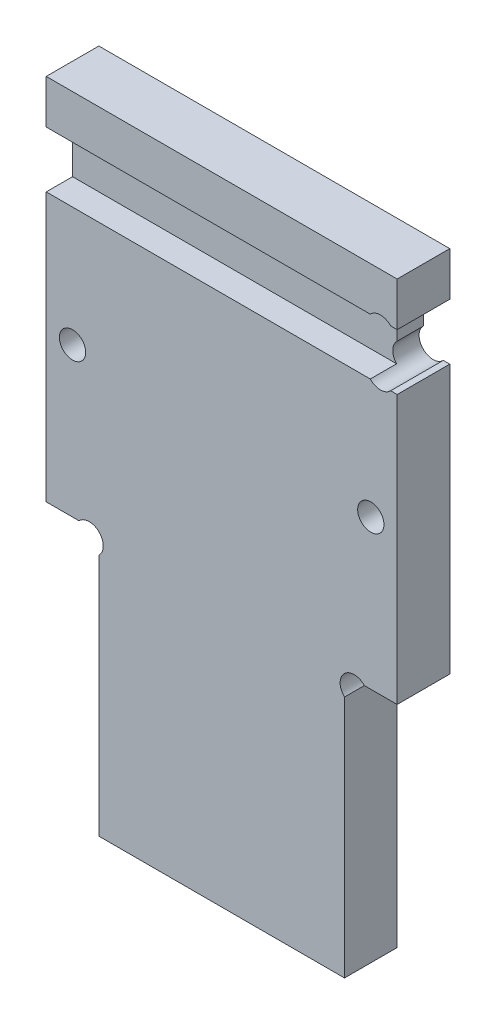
ISO-10303-21;
HEADER;
FILE_DESCRIPTION(('STEP AP214'),'2;1');
FILE_NAME('part.step','',(''),(''),'','','');
FILE_SCHEMA(('AUTOMOTIVE_DESIGN { 1 0 10303 214 1 1 1 1 }'));
ENDSEC;
DATA;
#1=APPLICATION_CONTEXT('core data for automotive mechanical design processes');
#2=APPLICATION_PROTOCOL_DEFINITION('international standard','automotive_design',2000,#1);
#3=PRODUCT_CONTEXT('',#1,'mechanical');
#4=PRODUCT('Part','Part','',(#3));
#5=PRODUCT_RELATED_PRODUCT_CATEGORY('part','',(#4));
#6=PRODUCT_DEFINITION_FORMATION('','',#4);
#7=PRODUCT_DEFINITION_CONTEXT('part definition',#1,'design');
#8=PRODUCT_DEFINITION('design','',#6,#7);
#9=PRODUCT_DEFINITION_SHAPE('','',#8);
#10=(LENGTH_UNIT() NAMED_UNIT(*) SI_UNIT(.MILLI.,.METRE.));
#11=(NAMED_UNIT(*) PLANE_ANGLE_UNIT() SI_UNIT($,.RADIAN.));
#12=(NAMED_UNIT(*) SI_UNIT($,.STERADIAN.) SOLID_ANGLE_UNIT());
#13=UNCERTAINTY_MEASURE_WITH_UNIT(LENGTH_MEASURE(1.E-05),#10,'distance_accuracy_value','');
#14=(GEOMETRIC_REPRESENTATION_CONTEXT(3) GLOBAL_UNCERTAINTY_ASSIGNED_CONTEXT((#13)) GLOBAL_UNIT_ASSIGNED_CONTEXT((#10,
#11,#12)) REPRESENTATION_CONTEXT('',''));
#15=CARTESIAN_POINT('',(0.,0.,0.));
#16=DIRECTION('',(0.,0.,1.));
#17=DIRECTION('',(1.,0.,0.));
#18=AXIS2_PLACEMENT_3D('',#15,#16,#17);
#19=CARTESIAN_POINT('',(-33.3422960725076,36.5735146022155,3.));
#20=DIRECTION('',(0.,-1.,0.));
#21=DIRECTION('',(0.,0.,-1.));
#22=AXIS2_PLACEMENT_3D('',#19,#20,#21);
#23=PLANE('',#22);
#24=DIRECTION('',(1.,0.,0.));
#25=VECTOR('',#24,1.);
#26=CARTESIAN_POINT('',(6.65770392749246,36.5735146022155,0.));
#27=LINE('',#26,#25);
#28=CARTESIAN_POINT('',(5.91959893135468,36.5735146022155,0.));
#29=VERTEX_POINT('',#28);
#30=CARTESIAN_POINT('',(6.65770392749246,36.5735146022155,0.));
#31=VERTEX_POINT('',#30);
#32=EDGE_CURVE('E180',#29,#31,#27,.T.);
#33=ORIENTED_EDGE('',*,*,#32,.F.);
#34=DIRECTION('',(0.,0.,1.));
#35=VECTOR('',#34,1.);
#36=CARTESIAN_POINT('',(5.91959893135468,36.5735146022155,0.));
#37=LINE('',#36,#35);
#38=CARTESIAN_POINT('',(5.91959893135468,36.5735146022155,6.));
#39=VERTEX_POINT('',#38);
#40=EDGE_CURVE('E166',#29,#39,#37,.T.);
#41=ORIENTED_EDGE('',*,*,#40,.T.);
#42=DIRECTION('',(1.,0.,0.));
#43=VECTOR('',#42,1.);
#44=CARTESIAN_POINT('',(-33.3422960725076,36.5735146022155,6.));
#45=LINE('',#44,#43);
#46=CARTESIAN_POINT('',(6.65770392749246,36.5735146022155,6.));
#47=VERTEX_POINT('',#46);
#48=EDGE_CURVE('E237',#39,#47,#45,.T.);
#49=ORIENTED_EDGE('',*,*,#48,.T.);
#50=DIRECTION('',(0.,0.,1.));
#51=VECTOR('',#50,1.);
#52=CARTESIAN_POINT('',(6.65770392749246,36.5735146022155,3.));
#53=LINE('',#52,#51);
#54=EDGE_CURVE('E188',#31,#47,#53,.T.);
#55=ORIENTED_EDGE('',*,*,#54,.F.);
#56=EDGE_LOOP('',(#33,#41,#49,#55));
#57=FACE_BOUND('',#56,.T.);
#58=ADVANCED_FACE('F32',(#57),#23,.F.);
#59=CARTESIAN_POINT('',(-33.3422960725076,42.9735146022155,3.));
#60=DIRECTION('',(0.,1.,0.));
#61=DIRECTION('',(0.,0.,1.));
#62=AXIS2_PLACEMENT_3D('',#59,#60,#61);
#63=PLANE('',#62);
#64=DIRECTION('',(-1.,0.,0.));
#65=VECTOR('',#64,1.);
#66=CARTESIAN_POINT('',(-33.3422960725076,42.9735146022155,3.));
#67=LINE('',#66,#65);
#68=CARTESIAN_POINT('',(3.59580892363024,42.9735146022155,3.));
#69=VERTEX_POINT('',#68);
#70=CARTESIAN_POINT('',(-33.3422960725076,42.9735146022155,3.));
#71=VERTEX_POINT('',#70);
#72=EDGE_CURVE('E251',#69,#71,#67,.T.);
#73=ORIENTED_EDGE('',*,*,#72,.F.);
#74=DIRECTION('',(0.,0.,1.));
#75=VECTOR('',#74,1.);
#76=CARTESIAN_POINT('',(3.59580892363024,42.9735146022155,0.));
#77=LINE('',#76,#75);
#78=CARTESIAN_POINT('',(3.59580892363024,42.9735146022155,6.));
#79=VERTEX_POINT('',#78);
#80=EDGE_CURVE('E327',#69,#79,#77,.T.);
#81=ORIENTED_EDGE('',*,*,#80,.T.);
#82=DIRECTION('',(-1.,0.,0.));
#83=VECTOR('',#82,1.);
#84=CARTESIAN_POINT('',(-33.3422960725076,42.9735146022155,6.));
#85=LINE('',#84,#83);
#86=CARTESIAN_POINT('',(-33.3422960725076,42.9735146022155,6.));
#87=VERTEX_POINT('',#86);
#88=EDGE_CURVE('E241',#79,#87,#85,.T.);
#89=ORIENTED_EDGE('',*,*,#88,.T.);
#90=DIRECTION('',(0.,0.,1.));
#91=VECTOR('',#90,1.);
#92=CARTESIAN_POINT('',(-33.3422960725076,42.9735146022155,3.));
#93=LINE('',#92,#91);
#94=EDGE_CURVE('E254',#71,#87,#93,.T.);
#95=ORIENTED_EDGE('',*,*,#94,.F.);
#96=EDGE_LOOP('',(#73,#81,#89,#95));
#97=FACE_BOUND('',#96,.T.);
#98=ADVANCED_FACE('F402',(#97),#63,.F.);
#99=CARTESIAN_POINT('',(6.65770392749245,47.9735146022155,6.));
#100=DIRECTION('',(-1.,0.,0.));
#101=DIRECTION('',(0.,-1.,0.));
#102=AXIS2_PLACEMENT_3D('',#99,#100,#101);
#103=PLANE('',#102);
#104=DIRECTION('',(0.,1.,0.));
#105=VECTOR('',#104,1.);
#106=CARTESIAN_POINT('',(6.65770392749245,47.9735146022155,0.));
#107=LINE('',#106,#105);
#108=CARTESIAN_POINT('',(6.65770392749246,5.97351460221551,0.));
#109=VERTEX_POINT('',#108);
#110=EDGE_CURVE('E268',#109,#31,#107,.T.);
#111=ORIENTED_EDGE('',*,*,#110,.T.);
#112=ORIENTED_EDGE('',*,*,#54,.T.);
#113=DIRECTION('',(0.,1.,0.));
#114=VECTOR('',#113,1.);
#115=CARTESIAN_POINT('',(6.65770392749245,47.9735146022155,6.));
#116=LINE('',#115,#114);
#117=CARTESIAN_POINT('',(6.65770392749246,5.97351460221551,6.));
#118=VERTEX_POINT('',#117);
#119=EDGE_CURVE('E280',#118,#47,#116,.T.);
#120=ORIENTED_EDGE('',*,*,#119,.F.);
#121=DIRECTION('',(0.,0.,1.));
#122=VECTOR('',#121,1.);
#123=CARTESIAN_POINT('',(6.65770392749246,5.97351460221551,0.));
#124=LINE('',#123,#122);
#125=EDGE_CURVE('E205',#109,#118,#124,.T.);
#126=ORIENTED_EDGE('',*,*,#125,.F.);
#127=EDGE_LOOP('',(#111,#112,#120,#126));
#128=FACE_BOUND('',#127,.T.);
#129=ADVANCED_FACE('F355',(#128),#103,.F.);
#130=CARTESIAN_POINT('',(-33.3422960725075,-24.0264853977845,6.));
#131=DIRECTION('',(0.,0.,1.));
#132=DIRECTION('',(1.,0.,0.));
#133=AXIS2_PLACEMENT_3D('',#130,#131,#132);
#134=PLANE('',#133);
#135=CARTESIAN_POINT('',(4.75770392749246,41.8735146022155,6.));
#136=DIRECTION('',(0.,0.,1.));
#137=DIRECTION('',(1.,0.,0.));
#138=AXIS2_PLACEMENT_3D('',#135,#136,#137);
#139=CIRCLE('',#138,1.59999999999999);
#140=CARTESIAN_POINT('',(5.91959893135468,42.9735146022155,6.));
#141=VERTEX_POINT('',#140);
#142=EDGE_CURVE('E173',#141,#79,#139,.T.);
#143=ORIENTED_EDGE('',*,*,#142,.F.);
#144=CARTESIAN_POINT('',(6.65770392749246,42.9735146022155,6.));
#145=VERTEX_POINT('',#144);
#146=EDGE_CURVE('E242',#145,#141,#85,.T.);
#147=ORIENTED_EDGE('',*,*,#146,.F.);
#148=CARTESIAN_POINT('',(6.65770392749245,47.9735146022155,6.));
#149=VERTEX_POINT('',#148);
#150=EDGE_CURVE('E279',#145,#149,#116,.T.);
#151=ORIENTED_EDGE('',*,*,#150,.T.);
#152=DIRECTION('',(-1.,0.,0.));
#153=VECTOR('',#152,1.);
#154=CARTESIAN_POINT('',(-33.3422960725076,47.9735146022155,6.));
#155=LINE('',#154,#153);
#156=CARTESIAN_POINT('',(-33.3422960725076,47.9735146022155,6.));
#157=VERTEX_POINT('',#156);
#158=EDGE_CURVE('E283',#149,#157,#155,.T.);
#159=ORIENTED_EDGE('',*,*,#158,.T.);
#160=DIRECTION('',(0.,-1.,0.));
#161=VECTOR('',#160,1.);
#162=CARTESIAN_POINT('',(-33.3422960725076,47.9735146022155,6.));
#163=LINE('',#162,#161);
#164=EDGE_CURVE('E273',#157,#87,#163,.T.);
#165=ORIENTED_EDGE('',*,*,#164,.T.);
#166=ORIENTED_EDGE('',*,*,#88,.F.);
#167=EDGE_LOOP('',(#143,#147,#151,#159,#165,#166));
#168=FACE_BOUND('',#167,.T.);
#169=ADVANCED_FACE('F400',(#168),#134,.T.);
#170=CARTESIAN_POINT('',(-33.3422960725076,47.9735146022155,6.));
#171=DIRECTION('',(1.,0.,0.));
#172=DIRECTION('',(0.,1.,0.));
#173=AXIS2_PLACEMENT_3D('',#170,#171,#172);
#174=PLANE('',#173);
#175=DIRECTION('',(0.,-1.,0.));
#176=VECTOR('',#175,1.);
#177=CARTESIAN_POINT('',(-33.3422960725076,47.9735146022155,0.));
#178=LINE('',#177,#176);
#179=CARTESIAN_POINT('',(-33.3422960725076,47.9735146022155,0.));
#180=VERTEX_POINT('',#179);
#181=CARTESIAN_POINT('',(-33.3422960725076,5.97351460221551,0.));
#182=VERTEX_POINT('',#181);
#183=EDGE_CURVE('E257',#180,#182,#178,.T.);
#184=ORIENTED_EDGE('',*,*,#183,.T.);
#185=DIRECTION('',(0.,0.,1.));
#186=VECTOR('',#185,1.);
#187=CARTESIAN_POINT('',(-33.3422960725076,5.97351460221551,0.));
#188=LINE('',#187,#186);
#189=CARTESIAN_POINT('',(-33.3422960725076,5.97351460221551,6.));
#190=VERTEX_POINT('',#189);
#191=EDGE_CURVE('E221',#182,#190,#188,.T.);
#192=ORIENTED_EDGE('',*,*,#191,.T.);
#193=CARTESIAN_POINT('',(-33.3422960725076,36.5735146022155,6.));
#194=VERTEX_POINT('',#193);
#195=EDGE_CURVE('E272',#194,#190,#163,.T.);
#196=ORIENTED_EDGE('',*,*,#195,.F.);
#197=DIRECTION('',(0.,0.,1.));
#198=VECTOR('',#197,1.);
#199=CARTESIAN_POINT('',(-33.3422960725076,36.5735146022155,3.));
#200=LINE('',#199,#198);
#201=CARTESIAN_POINT('',(-33.3422960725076,36.5735146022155,3.));
#202=VERTEX_POINT('',#201);
#203=EDGE_CURVE('E253',#202,#194,#200,.T.);
#204=ORIENTED_EDGE('',*,*,#203,.F.);
#205=DIRECTION('',(0.,-1.,0.));
#206=VECTOR('',#205,1.);
#207=CARTESIAN_POINT('',(-33.3422960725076,42.9735146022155,3.));
#208=LINE('',#207,#206);
#209=EDGE_CURVE('E245',#71,#202,#208,.T.);
#210=ORIENTED_EDGE('',*,*,#209,.F.);
#211=ORIENTED_EDGE('',*,*,#94,.T.);
#212=ORIENTED_EDGE('',*,*,#164,.F.);
#213=DIRECTION('',(0.,0.,-1.));
#214=VECTOR('',#213,1.);
#215=CARTESIAN_POINT('',(-33.3422960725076,47.9735146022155,6.));
#216=LINE('',#215,#214);
#217=EDGE_CURVE('E285',#157,#180,#216,.T.);
#218=ORIENTED_EDGE('',*,*,#217,.T.);
#219=EDGE_LOOP('',(#184,#192,#196,#204,#210,#211,#212,#218));
#220=FACE_BOUND('',#219,.T.);
#221=ADVANCED_FACE('F34',(#220),#174,.F.);
#222=CARTESIAN_POINT('',(-33.3422960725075,-24.0264853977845,6.));
#223=DIRECTION('',(0.,1.,0.));
#224=DIRECTION('',(0.,0.,1.));
#225=AXIS2_PLACEMENT_3D('',#222,#223,#224);
#226=PLANE('',#225);
#227=DIRECTION('',(1.,0.,0.));
#228=VECTOR('',#227,1.);
#229=CARTESIAN_POINT('',(-33.3422960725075,-24.0264853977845,0.));
#230=LINE('',#229,#228);
#231=CARTESIAN_POINT('',(-27.3422960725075,-24.0264853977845,0.));
#232=VERTEX_POINT('',#231);
#233=CARTESIAN_POINT('',(0.657703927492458,-24.0264853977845,0.));
#234=VERTEX_POINT('',#233);
#235=EDGE_CURVE('E264',#232,#234,#230,.T.);
#236=ORIENTED_EDGE('',*,*,#235,.T.);
#237=DIRECTION('',(0.,0.,1.));
#238=VECTOR('',#237,1.);
#239=CARTESIAN_POINT('',(0.657703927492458,-24.0264853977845,0.));
#240=LINE('',#239,#238);
#241=CARTESIAN_POINT('',(0.657703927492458,-24.0264853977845,6.));
#242=VERTEX_POINT('',#241);
#243=EDGE_CURVE('E206',#234,#242,#240,.T.);
#244=ORIENTED_EDGE('',*,*,#243,.T.);
#245=DIRECTION('',(1.,0.,0.));
#246=VECTOR('',#245,1.);
#247=CARTESIAN_POINT('',(-33.3422960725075,-24.0264853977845,6.));
#248=LINE('',#247,#246);
#249=CARTESIAN_POINT('',(-27.3422960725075,-24.0264853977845,6.));
#250=VERTEX_POINT('',#249);
#251=EDGE_CURVE('E276',#250,#242,#248,.T.);
#252=ORIENTED_EDGE('',*,*,#251,.F.);
#253=DIRECTION('',(0.,0.,1.));
#254=VECTOR('',#253,1.);
#255=CARTESIAN_POINT('',(-27.3422960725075,-24.0264853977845,0.));
#256=LINE('',#255,#254);
#257=EDGE_CURVE('E220',#232,#250,#256,.T.);
#258=ORIENTED_EDGE('',*,*,#257,.F.);
#259=EDGE_LOOP('',(#236,#244,#252,#258));
#260=FACE_BOUND('',#259,.T.);
#261=ADVANCED_FACE('F368',(#260),#226,.F.);
#262=DIRECTION('',(0.,0.,1.));
#263=VECTOR('',#262,1.);
#264=CARTESIAN_POINT('',(6.65770392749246,42.9735146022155,3.));
#265=LINE('',#264,#263);
#266=CARTESIAN_POINT('',(6.65770392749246,42.9735146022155,0.));
#267=VERTEX_POINT('',#266);
#268=EDGE_CURVE('E258',#267,#145,#265,.T.);
#269=ORIENTED_EDGE('',*,*,#268,.F.);
#270=CARTESIAN_POINT('',(6.65770392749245,47.9735146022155,0.));
#271=VERTEX_POINT('',#270);
#272=EDGE_CURVE('E267',#267,#271,#107,.T.);
#273=ORIENTED_EDGE('',*,*,#272,.T.);
#274=DIRECTION('',(0.,0.,-1.));
#275=VECTOR('',#274,1.);
#276=CARTESIAN_POINT('',(6.65770392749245,47.9735146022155,6.));
#277=LINE('',#276,#275);
#278=EDGE_CURVE('E288',#149,#271,#277,.T.);
#279=ORIENTED_EDGE('',*,*,#278,.F.);
#280=ORIENTED_EDGE('',*,*,#150,.F.);
#281=EDGE_LOOP('',(#269,#273,#279,#280));
#282=FACE_BOUND('',#281,.T.);
#283=ADVANCED_FACE('F391',(#282),#103,.F.);
#284=CARTESIAN_POINT('',(-33.3422960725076,47.9735146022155,6.));
#285=DIRECTION('',(0.,-1.,0.));
#286=DIRECTION('',(0.,0.,-1.));
#287=AXIS2_PLACEMENT_3D('',#284,#285,#286);
#288=PLANE('',#287);
#289=DIRECTION('',(-1.,0.,0.));
#290=VECTOR('',#289,1.);
#291=CARTESIAN_POINT('',(-33.3422960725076,47.9735146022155,0.));
#292=LINE('',#291,#290);
#293=EDGE_CURVE('E270',#271,#180,#292,.T.);
#294=ORIENTED_EDGE('',*,*,#293,.T.);
#295=ORIENTED_EDGE('',*,*,#217,.F.);
#296=ORIENTED_EDGE('',*,*,#158,.F.);
#297=ORIENTED_EDGE('',*,*,#278,.T.);
#298=EDGE_LOOP('',(#294,#295,#296,#297));
#299=FACE_BOUND('',#298,.T.);
#300=ADVANCED_FACE('F386',(#299),#288,.F.);
#301=CARTESIAN_POINT('',(4.75770392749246,37.6735146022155,6.));
#302=DIRECTION('',(0.,0.,1.));
#303=DIRECTION('',(1.,0.,0.));
#304=AXIS2_PLACEMENT_3D('',#301,#302,#303);
#305=CIRCLE('',#304,1.59999999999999);
#306=CARTESIAN_POINT('',(3.59580892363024,36.5735146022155,6.));
#307=VERTEX_POINT('',#306);
#308=EDGE_CURVE('E169',#307,#39,#305,.T.);
#309=ORIENTED_EDGE('',*,*,#308,.F.);
#310=EDGE_CURVE('E238',#194,#307,#45,.T.);
#311=ORIENTED_EDGE('',*,*,#310,.F.);
#312=ORIENTED_EDGE('',*,*,#195,.T.);
#313=DIRECTION('',(-1.,0.,0.));
#314=VECTOR('',#313,1.);
#315=CARTESIAN_POINT('',(-33.3422960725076,5.97351460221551,6.));
#316=LINE('',#315,#314);
#317=CARTESIAN_POINT('',(-29.6041910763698,5.97351460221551,6.));
#318=VERTEX_POINT('',#317);
#319=EDGE_CURVE('E213',#318,#190,#316,.T.);
#320=ORIENTED_EDGE('',*,*,#319,.F.);
#321=CARTESIAN_POINT('',(-28.4422960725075,4.87351460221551,6.));
#322=DIRECTION('',(0.,0.,1.));
#323=DIRECTION('',(1.,0.,0.));
#324=AXIS2_PLACEMENT_3D('',#321,#322,#323);
#325=CIRCLE('',#324,1.6);
#326=CARTESIAN_POINT('',(-27.3422960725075,3.71161959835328,6.));
#327=VERTEX_POINT('',#326);
#328=EDGE_CURVE('E314',#327,#318,#325,.T.);
#329=ORIENTED_EDGE('',*,*,#328,.F.);
#330=DIRECTION('',(0.,1.,0.));
#331=VECTOR('',#330,1.);
#332=CARTESIAN_POINT('',(-27.3422960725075,-24.0264853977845,6.));
#333=LINE('',#332,#331);
#334=EDGE_CURVE('E209',#250,#327,#333,.T.);
#335=ORIENTED_EDGE('',*,*,#334,.F.);
#336=ORIENTED_EDGE('',*,*,#251,.T.);
#337=DIRECTION('',(0.,-1.,0.));
#338=VECTOR('',#337,1.);
#339=CARTESIAN_POINT('',(0.657703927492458,-24.0264853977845,6.));
#340=LINE('',#339,#338);
#341=CARTESIAN_POINT('',(0.657703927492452,3.71161959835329,6.));
#342=VERTEX_POINT('',#341);
#343=EDGE_CURVE('E193',#342,#242,#340,.T.);
#344=ORIENTED_EDGE('',*,*,#343,.F.);
#345=CARTESIAN_POINT('',(1.75770392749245,4.87351460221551,6.));
#346=DIRECTION('',(0.,0.,1.));
#347=DIRECTION('',(1.,0.,0.));
#348=AXIS2_PLACEMENT_3D('',#345,#346,#347);
#349=CIRCLE('',#348,1.6);
#350=CARTESIAN_POINT('',(2.91959893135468,5.97351460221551,6.));
#351=VERTEX_POINT('',#350);
#352=EDGE_CURVE('E322',#351,#342,#349,.T.);
#353=ORIENTED_EDGE('',*,*,#352,.F.);
#354=DIRECTION('',(-1.,0.,0.));
#355=VECTOR('',#354,1.);
#356=CARTESIAN_POINT('',(6.65770392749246,5.97351460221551,6.));
#357=LINE('',#356,#355);
#358=EDGE_CURVE('E190',#118,#351,#357,.T.);
#359=ORIENTED_EDGE('',*,*,#358,.F.);
#360=ORIENTED_EDGE('',*,*,#119,.T.);
#361=ORIENTED_EDGE('',*,*,#48,.F.);
#362=EDGE_LOOP('',(#309,#311,#312,#320,#329,#335,#336,#344,#353,#359,#360,#361));
#363=FACE_BOUND('',#362,.T.);
#364=CARTESIAN_POINT('',(-30.3422960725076,22.9735146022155,6.));
#365=DIRECTION('',(0.,0.,1.));
#366=DIRECTION('',(1.,0.,0.));
#367=AXIS2_PLACEMENT_3D('',#364,#365,#366);
#368=CIRCLE('',#367,1.5);
#369=CARTESIAN_POINT('',(-28.8422960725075,22.9735146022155,6.));
#370=VERTEX_POINT('',#369);
#371=EDGE_CURVE('E224',#370,#370,#368,.T.);
#372=ORIENTED_EDGE('',*,*,#371,.F.);
#373=EDGE_LOOP('',(#372));
#374=FACE_BOUND('',#373,.T.);
#375=CARTESIAN_POINT('',(3.65770392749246,22.9735146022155,6.));
#376=DIRECTION('',(0.,0.,1.));
#377=DIRECTION('',(1.,0.,0.));
#378=AXIS2_PLACEMENT_3D('',#375,#376,#377);
#379=CIRCLE('',#378,1.5);
#380=CARTESIAN_POINT('',(5.15770392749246,22.9735146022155,6.));
#381=VERTEX_POINT('',#380);
#382=EDGE_CURVE('E231',#381,#381,#379,.T.);
#383=ORIENTED_EDGE('',*,*,#382,.F.);
#384=EDGE_LOOP('',(#383));
#385=FACE_BOUND('',#384,.T.);
#386=ADVANCED_FACE('F347',(#363,#374,#385),#134,.T.);
#387=CARTESIAN_POINT('',(-33.3422960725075,-24.0264853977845,0.));
#388=DIRECTION('',(0.,0.,1.));
#389=DIRECTION('',(1.,0.,0.));
#390=AXIS2_PLACEMENT_3D('',#387,#388,#389);
#391=PLANE('',#390);
#392=CARTESIAN_POINT('',(-30.3422960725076,22.9735146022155,0.));
#393=DIRECTION('',(0.,0.,1.));
#394=DIRECTION('',(1.,0.,0.));
#395=AXIS2_PLACEMENT_3D('',#392,#393,#394);
#396=CIRCLE('',#395,1.5);
#397=CARTESIAN_POINT('',(-28.8422960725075,22.9735146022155,0.));
#398=VERTEX_POINT('',#397);
#399=EDGE_CURVE('E228',#398,#398,#396,.T.);
#400=ORIENTED_EDGE('',*,*,#399,.T.);
#401=EDGE_LOOP('',(#400));
#402=FACE_BOUND('',#401,.T.);
#403=CARTESIAN_POINT('',(3.65770392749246,22.9735146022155,0.));
#404=DIRECTION('',(0.,0.,1.));
#405=DIRECTION('',(1.,0.,0.));
#406=AXIS2_PLACEMENT_3D('',#403,#404,#405);
#407=CIRCLE('',#406,1.5);
#408=CARTESIAN_POINT('',(5.15770392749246,22.9735146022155,0.));
#409=VERTEX_POINT('',#408);
#410=EDGE_CURVE('E234',#409,#409,#407,.T.);
#411=ORIENTED_EDGE('',*,*,#410,.T.);
#412=EDGE_LOOP('',(#411));
#413=FACE_BOUND('',#412,.T.);
#414=DIRECTION('',(0.,-1.,0.));
#415=VECTOR('',#414,1.);
#416=CARTESIAN_POINT('',(3.65770392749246,42.9735146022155,0.));
#417=LINE('',#416,#415);
#418=CARTESIAN_POINT('',(3.65770392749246,40.7116195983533,0.));
#419=VERTEX_POINT('',#418);
#420=CARTESIAN_POINT('',(3.65770392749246,38.8354096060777,0.));
#421=VERTEX_POINT('',#420);
#422=EDGE_CURVE('E184',#419,#421,#417,.T.);
#423=ORIENTED_EDGE('',*,*,#422,.T.);
#424=CARTESIAN_POINT('',(4.75770392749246,37.6735146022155,0.));
#425=DIRECTION('',(0.,0.,1.));
#426=DIRECTION('',(1.,0.,0.));
#427=AXIS2_PLACEMENT_3D('',#424,#425,#426);
#428=CIRCLE('',#427,1.59999999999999);
#429=EDGE_CURVE('E47',#421,#29,#428,.T.);
#430=ORIENTED_EDGE('',*,*,#429,.T.);
#431=ORIENTED_EDGE('',*,*,#32,.T.);
#432=ORIENTED_EDGE('',*,*,#110,.F.);
#433=DIRECTION('',(-1.,0.,0.));
#434=VECTOR('',#433,1.);
#435=CARTESIAN_POINT('',(6.65770392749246,5.97351460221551,0.));
#436=LINE('',#435,#434);
#437=CARTESIAN_POINT('',(2.91959893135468,5.97351460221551,0.));
#438=VERTEX_POINT('',#437);
#439=EDGE_CURVE('E200',#109,#438,#436,.T.);
#440=ORIENTED_EDGE('',*,*,#439,.T.);
#441=CARTESIAN_POINT('',(1.75770392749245,4.87351460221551,0.));
#442=DIRECTION('',(0.,0.,1.));
#443=DIRECTION('',(1.,0.,0.));
#444=AXIS2_PLACEMENT_3D('',#441,#442,#443);
#445=CIRCLE('',#444,1.6);
#446=CARTESIAN_POINT('',(0.657703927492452,3.71161959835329,0.));
#447=VERTEX_POINT('',#446);
#448=EDGE_CURVE('E319',#438,#447,#445,.T.);
#449=ORIENTED_EDGE('',*,*,#448,.T.);
#450=DIRECTION('',(0.,-1.,0.));
#451=VECTOR('',#450,1.);
#452=CARTESIAN_POINT('',(0.657703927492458,-24.0264853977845,0.));
#453=LINE('',#452,#451);
#454=EDGE_CURVE('E203',#447,#234,#453,.T.);
#455=ORIENTED_EDGE('',*,*,#454,.T.);
#456=ORIENTED_EDGE('',*,*,#235,.F.);
#457=DIRECTION('',(0.,1.,0.));
#458=VECTOR('',#457,1.);
#459=CARTESIAN_POINT('',(-27.3422960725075,-24.0264853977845,0.));
#460=LINE('',#459,#458);
#461=CARTESIAN_POINT('',(-27.3422960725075,3.71161959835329,0.));
#462=VERTEX_POINT('',#461);
#463=EDGE_CURVE('E215',#232,#462,#460,.T.);
#464=ORIENTED_EDGE('',*,*,#463,.T.);
#465=CARTESIAN_POINT('',(-28.4422960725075,4.87351460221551,0.));
#466=DIRECTION('',(0.,0.,1.));
#467=DIRECTION('',(1.,0.,0.));
#468=AXIS2_PLACEMENT_3D('',#465,#466,#467);
#469=CIRCLE('',#468,1.6);
#470=CARTESIAN_POINT('',(-29.6041910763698,5.97351460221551,0.));
#471=VERTEX_POINT('',#470);
#472=EDGE_CURVE('E309',#462,#471,#469,.T.);
#473=ORIENTED_EDGE('',*,*,#472,.T.);
#474=DIRECTION('',(-1.,0.,0.));
#475=VECTOR('',#474,1.);
#476=CARTESIAN_POINT('',(-33.3422960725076,5.97351460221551,0.));
#477=LINE('',#476,#475);
#478=EDGE_CURVE('E218',#471,#182,#477,.T.);
#479=ORIENTED_EDGE('',*,*,#478,.T.);
#480=ORIENTED_EDGE('',*,*,#183,.F.);
#481=ORIENTED_EDGE('',*,*,#293,.F.);
#482=ORIENTED_EDGE('',*,*,#272,.F.);
#483=DIRECTION('',(-1.,0.,0.));
#484=VECTOR('',#483,1.);
#485=CARTESIAN_POINT('',(6.65770392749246,42.9735146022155,0.));
#486=LINE('',#485,#484);
#487=CARTESIAN_POINT('',(5.91959893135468,42.9735146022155,0.));
#488=VERTEX_POINT('',#487);
#489=EDGE_CURVE('E195',#267,#488,#486,.T.);
#490=ORIENTED_EDGE('',*,*,#489,.T.);
#491=CARTESIAN_POINT('',(4.75770392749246,41.8735146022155,0.));
#492=DIRECTION('',(0.,0.,1.));
#493=DIRECTION('',(1.,0.,0.));
#494=AXIS2_PLACEMENT_3D('',#491,#492,#493);
#495=CIRCLE('',#494,1.59999999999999);
#496=EDGE_CURVE('E331',#488,#419,#495,.T.);
#497=ORIENTED_EDGE('',*,*,#496,.T.);
#498=EDGE_LOOP('',(#423,#430,#431,#432,#440,#449,#455,#456,#464,#473,#479,#480,#481,#482,#490,#497));
#499=FACE_BOUND('',#498,.T.);
#500=ADVANCED_FACE('F178',(#402,#413,#499),#391,.F.);
#501=ORIENTED_EDGE('',*,*,#146,.T.);
#502=DIRECTION('',(0.,0.,1.));
#503=VECTOR('',#502,1.);
#504=CARTESIAN_POINT('',(5.91959893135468,42.9735146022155,0.));
#505=LINE('',#504,#503);
#506=EDGE_CURVE('E324',#141,#488,#505,.F.);
#507=ORIENTED_EDGE('',*,*,#506,.T.);
#508=ORIENTED_EDGE('',*,*,#489,.F.);
#509=ORIENTED_EDGE('',*,*,#268,.T.);
#510=EDGE_LOOP('',(#501,#507,#508,#509));
#511=FACE_BOUND('',#510,.T.);
#512=ADVANCED_FACE('F395',(#511),#63,.F.);
#513=ORIENTED_EDGE('',*,*,#310,.T.);
#514=DIRECTION('',(0.,0.,1.));
#515=VECTOR('',#514,1.);
#516=CARTESIAN_POINT('',(3.59580892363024,36.5735146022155,0.));
#517=LINE('',#516,#515);
#518=CARTESIAN_POINT('',(3.59580892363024,36.5735146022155,3.));
#519=VERTEX_POINT('',#518);
#520=EDGE_CURVE('E174',#307,#519,#517,.F.);
#521=ORIENTED_EDGE('',*,*,#520,.T.);
#522=DIRECTION('',(1.,0.,0.));
#523=VECTOR('',#522,1.);
#524=CARTESIAN_POINT('',(-33.3422960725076,36.5735146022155,3.));
#525=LINE('',#524,#523);
#526=EDGE_CURVE('E248',#202,#519,#525,.T.);
#527=ORIENTED_EDGE('',*,*,#526,.F.);
#528=ORIENTED_EDGE('',*,*,#203,.T.);
#529=EDGE_LOOP('',(#513,#521,#527,#528));
#530=FACE_BOUND('',#529,.T.);
#531=ADVANCED_FACE('F338',(#530),#23,.F.);
#532=CARTESIAN_POINT('',(-33.3422960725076,36.5735146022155,3.));
#533=DIRECTION('',(0.,0.,1.));
#534=DIRECTION('',(1.,0.,0.));
#535=AXIS2_PLACEMENT_3D('',#532,#533,#534);
#536=PLANE('',#535);
#537=CARTESIAN_POINT('',(4.75770392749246,37.6735146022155,3.));
#538=DIRECTION('',(0.,0.,1.));
#539=DIRECTION('',(1.,0.,0.));
#540=AXIS2_PLACEMENT_3D('',#537,#538,#539);
#541=CIRCLE('',#540,1.59999999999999);
#542=CARTESIAN_POINT('',(3.65770392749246,38.8354096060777,3.));
#543=VERTEX_POINT('',#542);
#544=EDGE_CURVE('E185',#543,#519,#541,.T.);
#545=ORIENTED_EDGE('',*,*,#544,.F.);
#546=DIRECTION('',(0.,-1.,0.));
#547=VECTOR('',#546,1.);
#548=CARTESIAN_POINT('',(3.65770392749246,42.9735146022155,3.));
#549=LINE('',#548,#547);
#550=CARTESIAN_POINT('',(3.65770392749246,40.7116195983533,3.));
#551=VERTEX_POINT('',#550);
#552=EDGE_CURVE('E300',#551,#543,#549,.T.);
#553=ORIENTED_EDGE('',*,*,#552,.F.);
#554=CARTESIAN_POINT('',(4.75770392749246,41.8735146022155,3.));
#555=DIRECTION('',(0.,0.,1.));
#556=DIRECTION('',(1.,0.,0.));
#557=AXIS2_PLACEMENT_3D('',#554,#555,#556);
#558=CIRCLE('',#557,1.59999999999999);
#559=EDGE_CURVE('E54',#69,#551,#558,.T.);
#560=ORIENTED_EDGE('',*,*,#559,.F.);
#561=ORIENTED_EDGE('',*,*,#72,.T.);
#562=ORIENTED_EDGE('',*,*,#209,.T.);
#563=ORIENTED_EDGE('',*,*,#526,.T.);
#564=EDGE_LOOP('',(#545,#553,#560,#561,#562,#563));
#565=FACE_BOUND('',#564,.T.);
#566=ADVANCED_FACE('F303',(#565),#536,.T.);
#567=CARTESIAN_POINT('',(3.65770392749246,22.9735146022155,0.));
#568=DIRECTION('',(0.,0.,1.));
#569=DIRECTION('',(1.,0.,0.));
#570=AXIS2_PLACEMENT_3D('',#567,#568,#569);
#571=CYLINDRICAL_SURFACE('',#570,1.5);
#572=ORIENTED_EDGE('',*,*,#410,.F.);
#573=EDGE_LOOP('',(#572));
#574=FACE_BOUND('',#573,.T.);
#575=ORIENTED_EDGE('',*,*,#382,.T.);
#576=EDGE_LOOP('',(#575));
#577=FACE_BOUND('',#576,.T.);
#578=ADVANCED_FACE('F513',(#574,#577),#571,.F.);
#579=CARTESIAN_POINT('',(-30.3422960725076,22.9735146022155,0.));
#580=DIRECTION('',(0.,0.,1.));
#581=DIRECTION('',(1.,0.,0.));
#582=AXIS2_PLACEMENT_3D('',#579,#580,#581);
#583=CYLINDRICAL_SURFACE('',#582,1.5);
#584=ORIENTED_EDGE('',*,*,#399,.F.);
#585=EDGE_LOOP('',(#584));
#586=FACE_BOUND('',#585,.T.);
#587=ORIENTED_EDGE('',*,*,#371,.T.);
#588=EDGE_LOOP('',(#587));
#589=FACE_BOUND('',#588,.T.);
#590=ADVANCED_FACE('F518',(#586,#589),#583,.F.);
#591=CARTESIAN_POINT('',(-33.3422960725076,5.97351460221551,0.));
#592=DIRECTION('',(0.,1.,0.));
#593=DIRECTION('',(0.,0.,1.));
#594=AXIS2_PLACEMENT_3D('',#591,#592,#593);
#595=PLANE('',#594);
#596=ORIENTED_EDGE('',*,*,#478,.F.);
#597=DIRECTION('',(0.,0.,1.));
#598=VECTOR('',#597,1.);
#599=CARTESIAN_POINT('',(-29.6041910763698,5.97351460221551,0.));
#600=LINE('',#599,#598);
#601=EDGE_CURVE('E305',#471,#318,#600,.T.);
#602=ORIENTED_EDGE('',*,*,#601,.T.);
#603=ORIENTED_EDGE('',*,*,#319,.T.);
#604=ORIENTED_EDGE('',*,*,#191,.F.);
#605=EDGE_LOOP('',(#596,#602,#603,#604));
#606=FACE_BOUND('',#605,.T.);
#607=ADVANCED_FACE('F379',(#606),#595,.F.);
#608=CARTESIAN_POINT('',(-27.3422960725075,-24.0264853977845,0.));
#609=DIRECTION('',(1.,0.,0.));
#610=DIRECTION('',(0.,0.,-1.));
#611=AXIS2_PLACEMENT_3D('',#608,#609,#610);
#612=PLANE('',#611);
#613=ORIENTED_EDGE('',*,*,#334,.T.);
#614=DIRECTION('',(0.,0.,1.));
#615=VECTOR('',#614,1.);
#616=CARTESIAN_POINT('',(-27.3422960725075,3.71161959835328,0.));
#617=LINE('',#616,#615);
#618=EDGE_CURVE('E291',#327,#462,#617,.F.);
#619=ORIENTED_EDGE('',*,*,#618,.T.);
#620=ORIENTED_EDGE('',*,*,#463,.F.);
#621=ORIENTED_EDGE('',*,*,#257,.T.);
#622=EDGE_LOOP('',(#613,#619,#620,#621));
#623=FACE_BOUND('',#622,.T.);
#624=ADVANCED_FACE('F373',(#623),#612,.F.);
#625=CARTESIAN_POINT('',(0.657703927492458,-24.0264853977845,0.));
#626=DIRECTION('',(-1.,0.,0.));
#627=DIRECTION('',(0.,-1.,0.));
#628=AXIS2_PLACEMENT_3D('',#625,#626,#627);
#629=PLANE('',#628);
#630=ORIENTED_EDGE('',*,*,#454,.F.);
#631=DIRECTION('',(0.,0.,1.));
#632=VECTOR('',#631,1.);
#633=CARTESIAN_POINT('',(0.657703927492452,3.71161959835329,0.));
#634=LINE('',#633,#632);
#635=EDGE_CURVE('E316',#447,#342,#634,.T.);
#636=ORIENTED_EDGE('',*,*,#635,.T.);
#637=ORIENTED_EDGE('',*,*,#343,.T.);
#638=ORIENTED_EDGE('',*,*,#243,.F.);
#639=EDGE_LOOP('',(#630,#636,#637,#638));
#640=FACE_BOUND('',#639,.T.);
#641=ADVANCED_FACE('F366',(#640),#629,.F.);
#642=CARTESIAN_POINT('',(6.65770392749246,5.97351460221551,0.));
#643=DIRECTION('',(0.,1.,0.));
#644=DIRECTION('',(-1.,0.,0.));
#645=AXIS2_PLACEMENT_3D('',#642,#643,#644);
#646=PLANE('',#645);
#647=ORIENTED_EDGE('',*,*,#358,.T.);
#648=DIRECTION('',(0.,0.,1.));
#649=VECTOR('',#648,1.);
#650=CARTESIAN_POINT('',(2.91959893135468,5.97351460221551,0.));
#651=LINE('',#650,#649);
#652=EDGE_CURVE('E294',#351,#438,#651,.F.);
#653=ORIENTED_EDGE('',*,*,#652,.T.);
#654=ORIENTED_EDGE('',*,*,#439,.F.);
#655=ORIENTED_EDGE('',*,*,#125,.T.);
#656=EDGE_LOOP('',(#647,#653,#654,#655));
#657=FACE_BOUND('',#656,.T.);
#658=ADVANCED_FACE('F358',(#657),#646,.F.);
#659=CARTESIAN_POINT('',(3.65770392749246,42.9735146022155,0.));
#660=DIRECTION('',(-1.,0.,0.));
#661=DIRECTION('',(0.,-1.,0.));
#662=AXIS2_PLACEMENT_3D('',#659,#660,#661);
#663=PLANE('',#662);
#664=ORIENTED_EDGE('',*,*,#552,.T.);
#665=DIRECTION('',(0.,0.,1.));
#666=VECTOR('',#665,1.);
#667=CARTESIAN_POINT('',(3.65770392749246,38.8354096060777,0.));
#668=LINE('',#667,#666);
#669=EDGE_CURVE('E11',#543,#421,#668,.F.);
#670=ORIENTED_EDGE('',*,*,#669,.T.);
#671=ORIENTED_EDGE('',*,*,#422,.F.);
#672=DIRECTION('',(0.,0.,1.));
#673=VECTOR('',#672,1.);
#674=CARTESIAN_POINT('',(3.65770392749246,40.7116195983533,0.));
#675=LINE('',#674,#673);
#676=EDGE_CURVE('E40',#419,#551,#675,.T.);
#677=ORIENTED_EDGE('',*,*,#676,.T.);
#678=EDGE_LOOP('',(#664,#670,#671,#677));
#679=FACE_BOUND('',#678,.T.);
#680=ADVANCED_FACE('F299',(#679),#663,.F.);
#681=CARTESIAN_POINT('',(-28.4422960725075,4.87351460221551,0.));
#682=DIRECTION('',(0.,0.,1.));
#683=DIRECTION('',(1.,0.,0.));
#684=AXIS2_PLACEMENT_3D('',#681,#682,#683);
#685=CYLINDRICAL_SURFACE('',#684,1.6);
#686=ORIENTED_EDGE('',*,*,#472,.F.);
#687=ORIENTED_EDGE('',*,*,#618,.F.);
#688=ORIENTED_EDGE('',*,*,#328,.T.);
#689=ORIENTED_EDGE('',*,*,#601,.F.);
#690=EDGE_LOOP('',(#686,#687,#688,#689));
#691=FACE_BOUND('',#690,.T.);
#692=ADVANCED_FACE('F376',(#691),#685,.F.);
#693=CARTESIAN_POINT('',(1.75770392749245,4.87351460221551,0.));
#694=DIRECTION('',(0.,0.,1.));
#695=DIRECTION('',(1.,0.,0.));
#696=AXIS2_PLACEMENT_3D('',#693,#694,#695);
#697=CYLINDRICAL_SURFACE('',#696,1.6);
#698=ORIENTED_EDGE('',*,*,#448,.F.);
#699=ORIENTED_EDGE('',*,*,#652,.F.);
#700=ORIENTED_EDGE('',*,*,#352,.T.);
#701=ORIENTED_EDGE('',*,*,#635,.F.);
#702=EDGE_LOOP('',(#698,#699,#700,#701));
#703=FACE_BOUND('',#702,.T.);
#704=ADVANCED_FACE('F360',(#703),#697,.F.);
#705=CARTESIAN_POINT('',(4.75770392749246,41.8735146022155,0.));
#706=DIRECTION('',(0.,0.,1.));
#707=DIRECTION('',(1.,0.,0.));
#708=AXIS2_PLACEMENT_3D('',#705,#706,#707);
#709=CYLINDRICAL_SURFACE('',#708,1.59999999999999);
#710=ORIENTED_EDGE('',*,*,#142,.T.);
#711=ORIENTED_EDGE('',*,*,#80,.F.);
#712=ORIENTED_EDGE('',*,*,#559,.T.);
#713=ORIENTED_EDGE('',*,*,#676,.F.);
#714=ORIENTED_EDGE('',*,*,#496,.F.);
#715=ORIENTED_EDGE('',*,*,#506,.F.);
#716=EDGE_LOOP('',(#710,#711,#712,#713,#714,#715));
#717=FACE_BOUND('',#716,.T.);
#718=ADVANCED_FACE('F396',(#717),#709,.F.);
#719=CARTESIAN_POINT('',(4.75770392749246,37.6735146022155,0.));
#720=DIRECTION('',(0.,0.,1.));
#721=DIRECTION('',(1.,0.,0.));
#722=AXIS2_PLACEMENT_3D('',#719,#720,#721);
#723=CYLINDRICAL_SURFACE('',#722,1.59999999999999);
#724=ORIENTED_EDGE('',*,*,#429,.F.);
#725=ORIENTED_EDGE('',*,*,#669,.F.);
#726=ORIENTED_EDGE('',*,*,#544,.T.);
#727=ORIENTED_EDGE('',*,*,#520,.F.);
#728=ORIENTED_EDGE('',*,*,#308,.T.);
#729=ORIENTED_EDGE('',*,*,#40,.F.);
#730=EDGE_LOOP('',(#724,#725,#726,#727,#728,#729));
#731=FACE_BOUND('',#730,.T.);
#732=ADVANCED_FACE('F167',(#731),#723,.F.);
#733=CLOSED_SHELL('',(#58,#98,#129,#169,#221,#261,#283,#300,#386,#500,#512,#531,#566,#578,#590,
#607,#624,#641,#658,#680,#692,#704,#718,#732));
#734=MANIFOLD_SOLID_BREP('B2',#733);
#735=ADVANCED_BREP_SHAPE_REPRESENTATION('',(#18,#734),#14);
#736=SHAPE_DEFINITION_REPRESENTATION(#9,#735);
ENDSEC;
END-ISO-10303-21;
